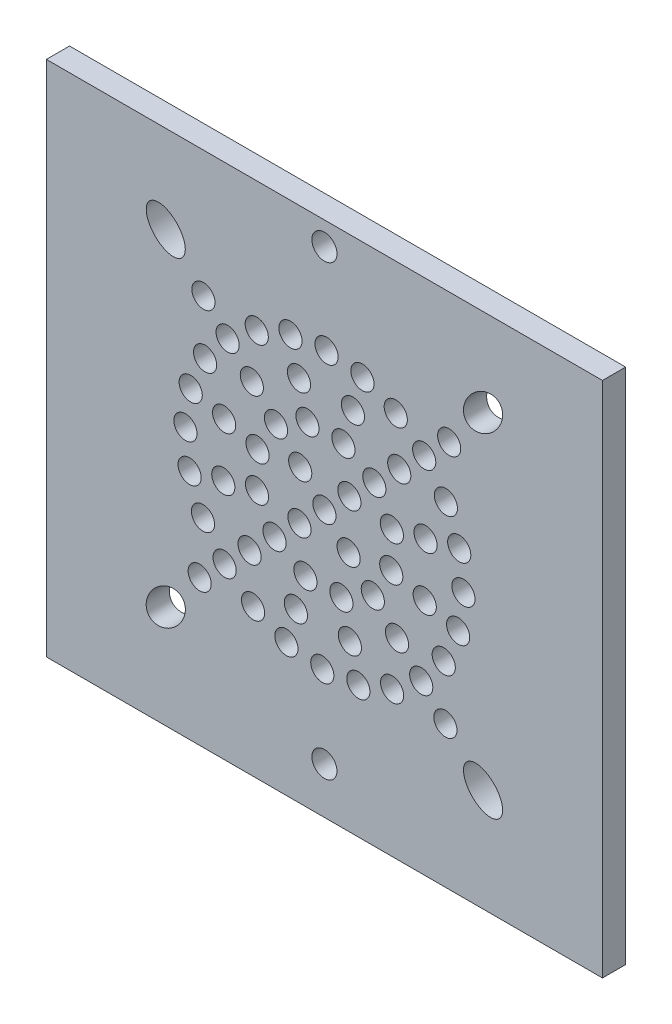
from build123d import *

# Parameters (mm, degrees)
CROQUIS1_W              = 72
CROQUIS1_H              = 67
SALIENTE_EXTRUIR1_DEPTH = 3
CROQUIS3_R              = 1.625
CROQUIS3_R_2            = 1.5
CROQUIS3_RX             = 3
CROQUIS3_RY             = 2
CORTAR_EXTRUIR1_DEPTH   = 3


with BuildPart() as part:
    # Croquis1 → Saliente-Extruir1 (new body)
    with BuildSketch(Plane.XY):
        with Locations((122.25, -8.443705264)):
            Rectangle(CROQUIS1_W, CROQUIS1_H)
    extrude(amount=SALIENTE_EXTRUIR1_DEPTH)

    # Croquis3 → Cortar-Extruir1 (cut)
    with BuildSketch(Plane(origin=(0, 0, 0), x_dir=(-1, 0, 0), z_dir=(0, 0, -1))):
        with Locations((-122.25, -35.943705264)):
            Circle(CROQUIS3_R)
        with Locations((-122.25, 22.056294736)):
            Circle(CROQUIS3_R)
        with Locations((-137.915748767, -23.594071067)):
            Circle(CROQUIS3_R_2)
        with Locations((-138.400365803, 8.222043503)):
            Circle(CROQUIS3_R_2)
        with Locations((-135.170292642, 5.08889375)):
            Circle(CROQUIS3_R_2)
        with Locations((-127.173002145, 9.869990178)):
            Circle(CROQUIS3_R_2)
        with Locations((-131.486369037, 8.005873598)):
            Circle(CROQUIS3_R_2)
        with Locations((-125.942251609, 5.541566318)):
            Circle(CROQUIS3_R_2)
        with Locations((-122.524140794, 10.554207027)):
            Circle(CROQUIS3_R_2)
        with Locations((-117.8565972, 10.011895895)):
            Circle(CROQUIS3_R_2)
        with Locations((-118.9549479, 5.647995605)):
            Circle(CROQUIS3_R_2)
        with Locations((-113.488456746, 8.280014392)):
            Circle(CROQUIS3_R_2)
        with Locations((-106.584251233, 8.706660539)):
            Circle(CROQUIS3_R_2)
        with Locations((-109.717400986, 5.476587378)):
            Circle(CROQUIS3_R_2)
        with Locations((-112.85055074, 2.246514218)):
            Circle(CROQUIS3_R_2)
        with Locations((-106.800421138, 1.792663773)):
            Circle(CROQUIS3_R_2)
        with Locations((-104.252087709, -7.16956447)):
            Circle(CROQUIS3_R_2)
        with Locations((-104.936304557, -2.520703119)):
            Circle(CROQUIS3_R_2)
        with Locations((-109.264728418, -3.751453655)):
            Circle(CROQUIS3_R_2)
        with Locations((-113.593152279, -4.982204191)):
            Circle(CROQUIS3_R_2)
        with Locations((-115.983700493, -0.983558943)):
            Circle(CROQUIS3_R_2)
        with Locations((-119.116850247, -4.213632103)):
            Circle(CROQUIS3_R_2)
        with Locations((-120.0532986, 1.284095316)):
            Circle(CROQUIS3_R_2)
        with Locations((-124.711501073, 1.213142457)):
            Circle(CROQUIS3_R_2)
        with Locations((-128.710146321, -1.177405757)):
            Circle(CROQUIS3_R_2)
        with Locations((-125.480073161, -4.310555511)):
            Circle(CROQUIS3_R_2)
        with Locations((-131.940219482, 1.955743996)):
            Circle(CROQUIS3_R_2)
        with Locations((-137.973719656, 1.31783799)):
            Circle(CROQUIS3_R_2)
        with Locations((-140.247912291, -7.717846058)):
            Circle(CROQUIS3_R_2)
        with Locations((-139.705601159, -3.050302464)):
            Circle(CROQUIS3_R_2)
        with Locations((-135.341700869, -4.148653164)):
            Circle(CROQUIS3_R_2)
        with Locations((-130.97780058, -5.247003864)):
            Circle(CROQUIS3_R_2)
        with Locations((-130.906847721, -9.905206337)):
            Circle(CROQUIS3_R_2)
        with Locations((-122.25, -7.443705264)):
            Circle(CROQUIS3_R_2)
        with Locations((-125.383149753, -10.673778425)):
            Circle(CROQUIS3_R_2)
        with Locations((-119.019926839, -10.576855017)):
            Circle(CROQUIS3_R_2)
        with Locations((-113.52219942, -9.640406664)):
            Circle(CROQUIS3_R_2)
        with Locations((-104.794398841, -11.837108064)):
            Circle(CROQUIS3_R_2)
        with Locations((-109.158299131, -10.738757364)):
            Circle(CROQUIS3_R_2)
        with Locations((-106.526280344, -16.205248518)):
            Circle(CROQUIS3_R_2)
        with Locations((-106.099634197, -23.109454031)):
            Circle(CROQUIS3_R_2)
        with Locations((-109.329707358, -19.976304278)):
            Circle(CROQUIS3_R_2)
        with Locations((-115.789853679, -13.710004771)):
            Circle(CROQUIS3_R_2)
        with Locations((-124.4467014, -16.171505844)):
            Circle(CROQUIS3_R_2)
        with Locations((-119.788498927, -16.100552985)):
            Circle(CROQUIS3_R_2)
        with Locations((-112.559780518, -16.843154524)):
            Circle(CROQUIS3_R_2)
        with Locations((-118.557748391, -20.428976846)):
            Circle(CROQUIS3_R_2)
        with Locations((-113.013630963, -22.893284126)):
            Circle(CROQUIS3_R_2)
        with Locations((-117.326997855, -24.757400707)):
            Circle(CROQUIS3_R_2)
        with Locations((-121.975859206, -25.441617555)):
            Circle(CROQUIS3_R_2)
        with Locations((-125.5450521, -20.535406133)):
            Circle(CROQUIS3_R_2)
        with Locations((-128.516299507, -13.903851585)):
            Circle(CROQUIS3_R_2)
        with Locations((-131.64944926, -17.133924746)):
            Circle(CROQUIS3_R_2)
        with Locations((-135.235271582, -11.135956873)):
            Circle(CROQUIS3_R_2)
        with Locations((-139.563695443, -12.366707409)):
            Circle(CROQUIS3_R_2)
        with Locations((-137.699578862, -16.680074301)):
            Circle(CROQUIS3_R_2)
        with Locations((-134.782599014, -20.363997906)):
            Circle(CROQUIS3_R_2)
        with Locations((-131.011543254, -23.16742492)):
            Circle(CROQUIS3_R_2)
        with Locations((-126.6434028, -24.899306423)):
            Circle(CROQUIS3_R_2)
        with Locations(Location((-142.789537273, 13.731218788), (0, 0, -45.872650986))):
            Ellipse(CROQUIS3_RX, CROQUIS3_RY)
        with Locations(Location((-101.710462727, 13.731218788), (0, 0, 46.334408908))):
            Ellipse(CROQUIS3_RX, CROQUIS3_RY)
        with Locations(Location((-101.710462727, -28.618629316), (0, 0, -45.872650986))):
            Ellipse(CROQUIS3_RX, CROQUIS3_RY)
        with Locations(Location((-142.789537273, -28.618629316), (0, 0, -134.127349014))):
            Ellipse(CROQUIS3_RX, CROQUIS3_RY)
    extrude(amount=-CORTAR_EXTRUIR1_DEPTH, mode=Mode.SUBTRACT)


solid = part.part
